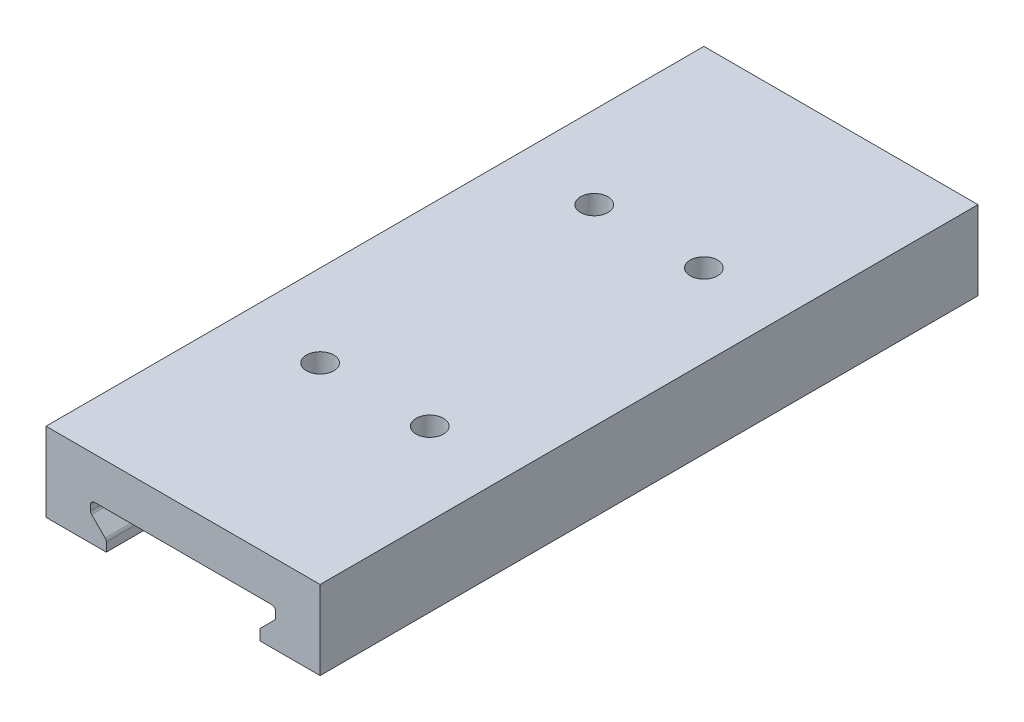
ISO-10303-21;
HEADER;
FILE_DESCRIPTION(('STEP AP214'),'2;1');
FILE_NAME('part.step','',(''),(''),'','','');
FILE_SCHEMA(('AUTOMOTIVE_DESIGN { 1 0 10303 214 1 1 1 1 }'));
ENDSEC;
DATA;
#1=APPLICATION_CONTEXT('core data for automotive mechanical design processes');
#2=APPLICATION_PROTOCOL_DEFINITION('international standard','automotive_design',2000,#1);
#3=PRODUCT_CONTEXT('',#1,'mechanical');
#4=PRODUCT('Part','Part','',(#3));
#5=PRODUCT_RELATED_PRODUCT_CATEGORY('part','',(#4));
#6=PRODUCT_DEFINITION_FORMATION('','',#4);
#7=PRODUCT_DEFINITION_CONTEXT('part definition',#1,'design');
#8=PRODUCT_DEFINITION('design','',#6,#7);
#9=PRODUCT_DEFINITION_SHAPE('','',#8);
#10=(LENGTH_UNIT() NAMED_UNIT(*) SI_UNIT(.MILLI.,.METRE.));
#11=(NAMED_UNIT(*) PLANE_ANGLE_UNIT() SI_UNIT($,.RADIAN.));
#12=(NAMED_UNIT(*) SI_UNIT($,.STERADIAN.) SOLID_ANGLE_UNIT());
#13=UNCERTAINTY_MEASURE_WITH_UNIT(LENGTH_MEASURE(1.E-05),#10,'distance_accuracy_value','');
#14=(GEOMETRIC_REPRESENTATION_CONTEXT(3) GLOBAL_UNCERTAINTY_ASSIGNED_CONTEXT((#13)) GLOBAL_UNIT_ASSIGNED_CONTEXT((#10,
#11,#12)) REPRESENTATION_CONTEXT('',''));
#15=CARTESIAN_POINT('',(0.,0.,0.));
#16=DIRECTION('',(0.,0.,1.));
#17=DIRECTION('',(1.,0.,0.));
#18=AXIS2_PLACEMENT_3D('',#15,#16,#17);
#19=CARTESIAN_POINT('',(-12.5,8.99999999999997,60.));
#20=DIRECTION('',(1.,0.,0.));
#21=DIRECTION('',(0.,0.,-1.));
#22=AXIS2_PLACEMENT_3D('',#19,#20,#21);
#23=PLANE('',#22);
#24=DIRECTION('',(0.,-0.999999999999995,0.));
#25=VECTOR('',#24,1.);
#26=CARTESIAN_POINT('',(-12.5,8.99999999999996,42.));
#27=LINE('',#26,#25);
#28=CARTESIAN_POINT('',(-12.5,1.89999999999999,42.));
#29=VERTEX_POINT('',#28);
#30=CARTESIAN_POINT('',(-12.5,1.8,42.));
#31=VERTEX_POINT('',#30);
#32=EDGE_CURVE('E285',#29,#31,#27,.T.);
#33=ORIENTED_EDGE('',*,*,#32,.F.);
#34=DIRECTION('',(0.,0.,1.));
#35=VECTOR('',#34,1.);
#36=CARTESIAN_POINT('',(-12.5000000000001,1.90000000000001,60.));
#37=LINE('',#36,#35);
#38=CARTESIAN_POINT('',(-12.5,1.89999999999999,42.05));
#39=VERTEX_POINT('',#38);
#40=EDGE_CURVE('E283',#29,#39,#37,.T.);
#41=ORIENTED_EDGE('',*,*,#40,.T.);
#42=DIRECTION('',(0.,0.999999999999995,0.));
#43=VECTOR('',#42,1.);
#44=CARTESIAN_POINT('',(-12.5,8.99999999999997,42.05));
#45=LINE('',#44,#43);
#46=CARTESIAN_POINT('',(-12.5000000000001,1.80000000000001,42.05));
#47=VERTEX_POINT('',#46);
#48=EDGE_CURVE('E268',#47,#39,#45,.T.);
#49=ORIENTED_EDGE('',*,*,#48,.F.);
#50=DIRECTION('',(0.,0.,-1.));
#51=VECTOR('',#50,1.);
#52=CARTESIAN_POINT('',(-12.5,1.80000000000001,60.));
#53=LINE('',#52,#51);
#54=CARTESIAN_POINT('',(-12.5,1.80000000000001,60.));
#55=VERTEX_POINT('',#54);
#56=EDGE_CURVE('E282',#55,#47,#53,.T.);
#57=ORIENTED_EDGE('',*,*,#56,.F.);
#58=DIRECTION('',(0.,-0.999999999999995,0.));
#59=VECTOR('',#58,1.);
#60=CARTESIAN_POINT('',(-12.5,8.99999999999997,60.));
#61=LINE('',#60,#59);
#62=CARTESIAN_POINT('',(-12.5,8.99999999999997,60.));
#63=VERTEX_POINT('',#62);
#64=EDGE_CURVE('E335',#63,#55,#61,.T.);
#65=ORIENTED_EDGE('',*,*,#64,.F.);
#66=DIRECTION('',(0.,0.,-1.));
#67=VECTOR('',#66,1.);
#68=CARTESIAN_POINT('',(-12.5,8.99999999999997,60.));
#69=LINE('',#68,#67);
#70=CARTESIAN_POINT('',(-12.5,8.99999999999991,0.));
#71=VERTEX_POINT('',#70);
#72=EDGE_CURVE('E320',#63,#71,#69,.T.);
#73=ORIENTED_EDGE('',*,*,#72,.T.);
#74=DIRECTION('',(0.,-0.999999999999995,0.));
#75=VECTOR('',#74,1.);
#76=CARTESIAN_POINT('',(-12.5,8.99999999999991,0.));
#77=LINE('',#76,#75);
#78=CARTESIAN_POINT('',(-12.5,1.79999999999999,0.));
#79=VERTEX_POINT('',#78);
#80=EDGE_CURVE('E348',#71,#79,#77,.T.);
#81=ORIENTED_EDGE('',*,*,#80,.T.);
#82=CARTESIAN_POINT('',(-12.5,1.79999999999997,17.9499999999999));
#83=VERTEX_POINT('',#82);
#84=EDGE_CURVE('E295',#83,#79,#53,.T.);
#85=ORIENTED_EDGE('',*,*,#84,.F.);
#86=DIRECTION('',(0.,0.999999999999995,0.));
#87=VECTOR('',#86,1.);
#88=CARTESIAN_POINT('',(-12.5,8.99999999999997,17.9499999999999));
#89=LINE('',#88,#87);
#90=CARTESIAN_POINT('',(-12.5000000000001,1.89999999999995,17.9499999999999));
#91=VERTEX_POINT('',#90);
#92=EDGE_CURVE('E435',#83,#91,#89,.T.);
#93=ORIENTED_EDGE('',*,*,#92,.T.);
#94=DIRECTION('',(0.,0.,1.));
#95=VECTOR('',#94,1.);
#96=CARTESIAN_POINT('',(-12.5000000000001,1.90000000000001,60.));
#97=LINE('',#96,#95);
#98=CARTESIAN_POINT('',(-12.5000000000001,1.89999999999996,17.9999999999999));
#99=VERTEX_POINT('',#98);
#100=EDGE_CURVE('E442',#91,#99,#97,.T.);
#101=ORIENTED_EDGE('',*,*,#100,.T.);
#102=DIRECTION('',(0.,-0.999999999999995,0.));
#103=VECTOR('',#102,1.);
#104=CARTESIAN_POINT('',(-12.5,8.99999999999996,17.9999999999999));
#105=LINE('',#104,#103);
#106=CARTESIAN_POINT('',(-12.5000000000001,1.79999999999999,17.9999999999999));
#107=VERTEX_POINT('',#106);
#108=EDGE_CURVE('E438',#99,#107,#105,.T.);
#109=ORIENTED_EDGE('',*,*,#108,.T.);
#110=EDGE_CURVE('E293',#31,#107,#53,.T.);
#111=ORIENTED_EDGE('',*,*,#110,.F.);
#112=EDGE_LOOP('',(#33,#41,#49,#57,#65,#73,#81,#85,#93,#101,#109,#111));
#113=FACE_BOUND('',#112,.T.);
#114=ADVANCED_FACE('F43',(#113),#23,.F.);
#115=CARTESIAN_POINT('',(-12.5,1.80000000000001,60.));
#116=DIRECTION('',(0.,0.999999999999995,0.));
#117=DIRECTION('',(0.,0.,1.));
#118=AXIS2_PLACEMENT_3D('',#115,#116,#117);
#119=PLANE('',#118);
#120=DIRECTION('',(-1.,0.,0.));
#121=VECTOR('',#120,1.);
#122=CARTESIAN_POINT('',(-4.62506841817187,1.80000000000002,42.));
#123=LINE('',#122,#121);
#124=CARTESIAN_POINT('',(-7.00000000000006,1.80000000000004,42.));
#125=VERTEX_POINT('',#124);
#126=EDGE_CURVE('E275',#125,#31,#123,.T.);
#127=ORIENTED_EDGE('',*,*,#126,.T.);
#128=ORIENTED_EDGE('',*,*,#110,.T.);
#129=DIRECTION('',(-1.,0.,0.));
#130=VECTOR('',#129,1.);
#131=CARTESIAN_POINT('',(-4.62506841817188,1.79999999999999,17.9999999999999));
#132=LINE('',#131,#130);
#133=CARTESIAN_POINT('',(-7.00000000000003,1.8,17.9999999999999));
#134=VERTEX_POINT('',#133);
#135=EDGE_CURVE('E455',#134,#107,#132,.T.);
#136=ORIENTED_EDGE('',*,*,#135,.F.);
#137=DIRECTION('',(0.,0.,1.));
#138=VECTOR('',#137,1.);
#139=CARTESIAN_POINT('',(-7.00000000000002,1.8,60.));
#140=LINE('',#139,#138);
#141=EDGE_CURVE('E355',#134,#125,#140,.T.);
#142=ORIENTED_EDGE('',*,*,#141,.T.);
#143=EDGE_LOOP('',(#127,#128,#136,#142));
#144=FACE_BOUND('',#143,.T.);
#145=ADVANCED_FACE('F473',(#144),#119,.F.);
#146=DIRECTION('',(1.,0.,0.));
#147=VECTOR('',#146,1.);
#148=CARTESIAN_POINT('',(-4.62506841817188,1.80000000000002,42.05));
#149=LINE('',#148,#147);
#150=CARTESIAN_POINT('',(-7.00000000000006,1.80000000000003,42.05));
#151=VERTEX_POINT('',#150);
#152=EDGE_CURVE('E264',#47,#151,#149,.T.);
#153=ORIENTED_EDGE('',*,*,#152,.T.);
#154=CARTESIAN_POINT('',(-7.00000000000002,1.8,60.));
#155=VERTEX_POINT('',#154);
#156=EDGE_CURVE('E356',#151,#155,#140,.T.);
#157=ORIENTED_EDGE('',*,*,#156,.T.);
#158=DIRECTION('',(1.,0.,0.));
#159=VECTOR('',#158,1.);
#160=CARTESIAN_POINT('',(-12.5,1.80000000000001,60.));
#161=LINE('',#160,#159);
#162=EDGE_CURVE('E289',#55,#155,#161,.T.);
#163=ORIENTED_EDGE('',*,*,#162,.F.);
#164=ORIENTED_EDGE('',*,*,#56,.T.);
#165=EDGE_LOOP('',(#153,#157,#163,#164));
#166=FACE_BOUND('',#165,.T.);
#167=ADVANCED_FACE('F287',(#166),#119,.F.);
#168=CARTESIAN_POINT('',(-7.00000000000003,2.76583282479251,60.));
#169=DIRECTION('',(-1.,0.,0.));
#170=DIRECTION('',(0.,-0.999999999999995,0.));
#171=AXIS2_PLACEMENT_3D('',#168,#169,#170);
#172=PLANE('',#171);
#173=DIRECTION('',(0.,0.999999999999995,0.));
#174=VECTOR('',#173,1.);
#175=CARTESIAN_POINT('',(-7.00000000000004,2.76583282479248,42.));
#176=LINE('',#175,#174);
#177=CARTESIAN_POINT('',(-7.00000000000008,1.90000000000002,42.));
#178=VERTEX_POINT('',#177);
#179=EDGE_CURVE('E11',#125,#178,#176,.T.);
#180=ORIENTED_EDGE('',*,*,#179,.F.);
#181=ORIENTED_EDGE('',*,*,#141,.F.);
#182=DIRECTION('',(0.,0.999999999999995,0.));
#183=VECTOR('',#182,1.);
#184=CARTESIAN_POINT('',(-7.00000000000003,2.76583282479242,18.));
#185=LINE('',#184,#183);
#186=CARTESIAN_POINT('',(-7.00000000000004,1.89999999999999,17.9999999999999));
#187=VERTEX_POINT('',#186);
#188=EDGE_CURVE('E488',#134,#187,#185,.T.);
#189=ORIENTED_EDGE('',*,*,#188,.T.);
#190=DIRECTION('',(0.,0.,-1.));
#191=VECTOR('',#190,1.);
#192=CARTESIAN_POINT('',(-6.99999999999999,1.90000000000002,60.0000000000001));
#193=LINE('',#192,#191);
#194=CARTESIAN_POINT('',(-7.00000000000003,1.89999999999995,17.9499999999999));
#195=VERTEX_POINT('',#194);
#196=EDGE_CURVE('E484',#187,#195,#193,.T.);
#197=ORIENTED_EDGE('',*,*,#196,.T.);
#198=DIRECTION('',(0.,-0.999999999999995,0.));
#199=VECTOR('',#198,1.);
#200=CARTESIAN_POINT('',(-7.00000000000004,2.76583282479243,17.95));
#201=LINE('',#200,#199);
#202=CARTESIAN_POINT('',(-7.00000000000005,1.79999999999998,17.9499999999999));
#203=VERTEX_POINT('',#202);
#204=EDGE_CURVE('E493',#195,#203,#201,.T.);
#205=ORIENTED_EDGE('',*,*,#204,.T.);
#206=CARTESIAN_POINT('',(-7.00000000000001,1.79999999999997,0.));
#207=VERTEX_POINT('',#206);
#208=EDGE_CURVE('E351',#207,#203,#140,.T.);
#209=ORIENTED_EDGE('',*,*,#208,.F.);
#210=DIRECTION('',(0.,-0.999999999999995,0.));
#211=VECTOR('',#210,1.);
#212=CARTESIAN_POINT('',(-7.00000000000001,1.79999999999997,0.));
#213=LINE('',#212,#211);
#214=CARTESIAN_POINT('',(-7.00000000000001,2.62085807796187,0.));
#215=VERTEX_POINT('',#214);
#216=EDGE_CURVE('E292',#215,#207,#213,.T.);
#217=ORIENTED_EDGE('',*,*,#216,.F.);
#218=DIRECTION('',(0.,0.,-1.));
#219=VECTOR('',#218,1.);
#220=CARTESIAN_POINT('',(-6.99999999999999,2.62085807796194,60.0000000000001));
#221=LINE('',#220,#219);
#222=CARTESIAN_POINT('',(-6.99999999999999,2.62085807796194,60.0000000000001));
#223=VERTEX_POINT('',#222);
#224=EDGE_CURVE('E575',#215,#223,#221,.F.);
#225=ORIENTED_EDGE('',*,*,#224,.T.);
#226=DIRECTION('',(0.,0.999999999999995,0.));
#227=VECTOR('',#226,1.);
#228=CARTESIAN_POINT('',(-7.00000000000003,2.76583282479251,60.));
#229=LINE('',#228,#227);
#230=EDGE_CURVE('E369',#155,#223,#229,.T.);
#231=ORIENTED_EDGE('',*,*,#230,.F.);
#232=ORIENTED_EDGE('',*,*,#156,.F.);
#233=DIRECTION('',(0.,-0.999999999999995,0.));
#234=VECTOR('',#233,1.);
#235=CARTESIAN_POINT('',(-7.00000000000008,2.76583282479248,42.05));
#236=LINE('',#235,#234);
#237=CARTESIAN_POINT('',(-7.00000000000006,1.90000000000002,42.05));
#238=VERTEX_POINT('',#237);
#239=EDGE_CURVE('E51',#238,#151,#236,.T.);
#240=ORIENTED_EDGE('',*,*,#239,.F.);
#241=DIRECTION('',(0.,0.,-1.));
#242=VECTOR('',#241,1.);
#243=CARTESIAN_POINT('',(-6.99999999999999,1.90000000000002,60.0000000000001));
#244=LINE('',#243,#242);
#245=EDGE_CURVE('E502',#238,#178,#244,.T.);
#246=ORIENTED_EDGE('',*,*,#245,.T.);
#247=EDGE_LOOP('',(#180,#181,#189,#197,#205,#209,#217,#225,#231,#232,#240,#246));
#248=FACE_BOUND('',#247,.T.);
#249=ADVANCED_FACE('F658',(#248),#172,.F.);
#250=ORIENTED_EDGE('',*,*,#208,.T.);
#251=DIRECTION('',(1.,0.,0.));
#252=VECTOR('',#251,1.);
#253=CARTESIAN_POINT('',(-4.62506841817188,1.79999999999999,17.9499999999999));
#254=LINE('',#253,#252);
#255=EDGE_CURVE('E452',#83,#203,#254,.T.);
#256=ORIENTED_EDGE('',*,*,#255,.F.);
#257=ORIENTED_EDGE('',*,*,#84,.T.);
#258=DIRECTION('',(1.,0.,0.));
#259=VECTOR('',#258,1.);
#260=CARTESIAN_POINT('',(-12.5,1.79999999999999,0.));
#261=LINE('',#260,#259);
#262=EDGE_CURVE('E344',#79,#207,#261,.T.);
#263=ORIENTED_EDGE('',*,*,#262,.T.);
#264=EDGE_LOOP('',(#250,#256,#257,#263));
#265=FACE_BOUND('',#264,.T.);
#266=ADVANCED_FACE('F657',(#265),#119,.F.);
#267=DIRECTION('',(0.,0.,1.));
#268=VECTOR('',#267,1.);
#269=CARTESIAN_POINT('',(6.99999999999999,1.80000000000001,60.0000000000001));
#270=LINE('',#269,#268);
#271=CARTESIAN_POINT('',(6.99999999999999,1.79999999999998,0.));
#272=VERTEX_POINT('',#271);
#273=CARTESIAN_POINT('',(6.99999999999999,1.80000000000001,60.0000000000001));
#274=VERTEX_POINT('',#273);
#275=EDGE_CURVE('E385',#272,#274,#270,.T.);
#276=ORIENTED_EDGE('',*,*,#275,.F.);
#277=CARTESIAN_POINT('',(12.5,1.79999999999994,0.));
#278=VERTEX_POINT('',#277);
#279=EDGE_CURVE('E347',#272,#278,#261,.T.);
#280=ORIENTED_EDGE('',*,*,#279,.T.);
#281=DIRECTION('',(0.,0.,-1.));
#282=VECTOR('',#281,1.);
#283=CARTESIAN_POINT('',(12.5,1.80000000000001,60.0000000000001));
#284=LINE('',#283,#282);
#285=CARTESIAN_POINT('',(12.5,1.80000000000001,60.0000000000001));
#286=VERTEX_POINT('',#285);
#287=EDGE_CURVE('E303',#286,#278,#284,.T.);
#288=ORIENTED_EDGE('',*,*,#287,.F.);
#289=EDGE_CURVE('E334',#274,#286,#161,.T.);
#290=ORIENTED_EDGE('',*,*,#289,.F.);
#291=EDGE_LOOP('',(#276,#280,#288,#290));
#292=FACE_BOUND('',#291,.T.);
#293=ADVANCED_FACE('F648',(#292),#119,.F.);
#294=CARTESIAN_POINT('',(-12.5,1.80000000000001,60.));
#295=DIRECTION('',(0.,0.,1.));
#296=DIRECTION('',(1.,0.,0.));
#297=AXIS2_PLACEMENT_3D('',#294,#295,#296);
#298=PLANE('',#297);
#299=DIRECTION('',(0.707106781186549,0.707106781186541,0.));
#300=VECTOR('',#299,1.);
#301=CARTESIAN_POINT('',(8.43416717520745,4.20000000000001,60.0000000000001));
#302=LINE('',#301,#300);
#303=CARTESIAN_POINT('',(7.10251262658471,2.86834545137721,60.0000000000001));
#304=VERTEX_POINT('',#303);
#305=CARTESIAN_POINT('',(8.33165454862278,4.09748737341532,60.));
#306=VERTEX_POINT('',#305);
#307=EDGE_CURVE('E392',#304,#306,#302,.T.);
#308=ORIENTED_EDGE('',*,*,#307,.F.);
#309=CARTESIAN_POINT('',(7.35000000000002,2.62085807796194,60.));
#310=DIRECTION('',(0.,0.,1.));
#311=DIRECTION('',(1.,0.,0.));
#312=AXIS2_PLACEMENT_3D('',#309,#310,#311);
#313=CIRCLE('',#312,0.35);
#314=CARTESIAN_POINT('',(7.00000000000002,2.62085807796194,60.));
#315=VERTEX_POINT('',#314);
#316=EDGE_CURVE('E532',#304,#315,#313,.T.);
#317=ORIENTED_EDGE('',*,*,#316,.T.);
#318=DIRECTION('',(0.,0.999999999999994,0.));
#319=VECTOR('',#318,1.);
#320=CARTESIAN_POINT('',(7.00000000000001,2.76583282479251,60.));
#321=LINE('',#320,#319);
#322=EDGE_CURVE('E388',#274,#315,#321,.T.);
#323=ORIENTED_EDGE('',*,*,#322,.F.);
#324=ORIENTED_EDGE('',*,*,#289,.T.);
#325=DIRECTION('',(0.,0.999999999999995,0.));
#326=VECTOR('',#325,1.);
#327=CARTESIAN_POINT('',(12.5,8.99999999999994,60.));
#328=LINE('',#327,#326);
#329=CARTESIAN_POINT('',(12.5,8.99999999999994,60.));
#330=VERTEX_POINT('',#329);
#331=EDGE_CURVE('E329',#286,#330,#328,.T.);
#332=ORIENTED_EDGE('',*,*,#331,.T.);
#333=DIRECTION('',(-1.,0.,0.));
#334=VECTOR('',#333,1.);
#335=CARTESIAN_POINT('',(-12.5,8.99999999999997,60.));
#336=LINE('',#335,#334);
#337=EDGE_CURVE('E326',#330,#63,#336,.T.);
#338=ORIENTED_EDGE('',*,*,#337,.T.);
#339=ORIENTED_EDGE('',*,*,#64,.T.);
#340=ORIENTED_EDGE('',*,*,#162,.T.);
#341=ORIENTED_EDGE('',*,*,#230,.T.);
#342=CARTESIAN_POINT('',(-7.35000000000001,2.62085807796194,60.));
#343=DIRECTION('',(0.,0.,1.));
#344=DIRECTION('',(1.,0.,0.));
#345=AXIS2_PLACEMENT_3D('',#342,#343,#344);
#346=CIRCLE('',#345,0.35);
#347=CARTESIAN_POINT('',(-7.10251262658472,2.86834545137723,60.0000000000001));
#348=VERTEX_POINT('',#347);
#349=EDGE_CURVE('E572',#223,#348,#346,.T.);
#350=ORIENTED_EDGE('',*,*,#349,.T.);
#351=DIRECTION('',(-0.707106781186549,0.707106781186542,0.));
#352=VECTOR('',#351,1.);
#353=CARTESIAN_POINT('',(-8.43416717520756,4.20000000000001,60.0000000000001));
#354=LINE('',#353,#352);
#355=CARTESIAN_POINT('',(-8.33165454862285,4.09748737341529,60.));
#356=VERTEX_POINT('',#355);
#357=EDGE_CURVE('E365',#348,#356,#354,.T.);
#358=ORIENTED_EDGE('',*,*,#357,.T.);
#359=CARTESIAN_POINT('',(-8.08416717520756,4.34497474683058,60.));
#360=DIRECTION('',(0.,0.,1.));
#361=DIRECTION('',(1.,0.,0.));
#362=AXIS2_PLACEMENT_3D('',#359,#360,#361);
#363=CIRCLE('',#362,0.35);
#364=CARTESIAN_POINT('',(-8.43416717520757,4.3449747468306,60.));
#365=VERTEX_POINT('',#364);
#366=EDGE_CURVE('E555',#356,#365,#363,.F.);
#367=ORIENTED_EDGE('',*,*,#366,.T.);
#368=DIRECTION('',(0.,0.999999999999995,0.));
#369=VECTOR('',#368,1.);
#370=CARTESIAN_POINT('',(-8.43416717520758,5.19999999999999,60.));
#371=LINE('',#370,#369);
#372=CARTESIAN_POINT('',(-8.43416717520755,4.85000000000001,60.));
#373=VERTEX_POINT('',#372);
#374=EDGE_CURVE('E361',#365,#373,#371,.T.);
#375=ORIENTED_EDGE('',*,*,#374,.T.);
#376=CARTESIAN_POINT('',(-8.08416717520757,4.85000000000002,60.));
#377=DIRECTION('',(0.,0.,1.));
#378=DIRECTION('',(1.,0.,0.));
#379=AXIS2_PLACEMENT_3D('',#376,#377,#378);
#380=CIRCLE('',#379,0.35);
#381=CARTESIAN_POINT('',(-8.08416717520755,5.2,60.));
#382=VERTEX_POINT('',#381);
#383=EDGE_CURVE('E549',#373,#382,#380,.F.);
#384=ORIENTED_EDGE('',*,*,#383,.T.);
#385=DIRECTION('',(1.,0.,0.));
#386=VECTOR('',#385,1.);
#387=CARTESIAN_POINT('',(-7.00000000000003,5.20000000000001,60.));
#388=LINE('',#387,#386);
#389=CARTESIAN_POINT('',(8.08416717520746,5.19999999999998,60.));
#390=VERTEX_POINT('',#389);
#391=EDGE_CURVE('E357',#382,#390,#388,.T.);
#392=ORIENTED_EDGE('',*,*,#391,.T.);
#393=CARTESIAN_POINT('',(8.08416717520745,4.85000000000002,60.));
#394=DIRECTION('',(0.,0.,1.));
#395=DIRECTION('',(1.,0.,0.));
#396=AXIS2_PLACEMENT_3D('',#393,#394,#395);
#397=CIRCLE('',#396,0.35);
#398=CARTESIAN_POINT('',(8.43416717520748,4.85000000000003,60.));
#399=VERTEX_POINT('',#398);
#400=EDGE_CURVE('E489',#390,#399,#397,.F.);
#401=ORIENTED_EDGE('',*,*,#400,.T.);
#402=DIRECTION('',(0.,0.999999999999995,0.));
#403=VECTOR('',#402,1.);
#404=CARTESIAN_POINT('',(8.43416717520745,5.2,60.));
#405=LINE('',#404,#403);
#406=CARTESIAN_POINT('',(8.43416717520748,4.34497474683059,60.));
#407=VERTEX_POINT('',#406);
#408=EDGE_CURVE('E396',#407,#399,#405,.T.);
#409=ORIENTED_EDGE('',*,*,#408,.F.);
#410=CARTESIAN_POINT('',(8.08416717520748,4.3449747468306,60.));
#411=DIRECTION('',(0.,0.,1.));
#412=DIRECTION('',(1.,0.,0.));
#413=AXIS2_PLACEMENT_3D('',#410,#411,#412);
#414=CIRCLE('',#413,0.35);
#415=EDGE_CURVE('E517',#407,#306,#414,.F.);
#416=ORIENTED_EDGE('',*,*,#415,.T.);
#417=EDGE_LOOP('',(#308,#317,#323,#324,#332,#338,#339,#340,#341,#350,#358,#367,#375,#384,#392,
#401,#409,#416));
#418=FACE_BOUND('',#417,.T.);
#419=ADVANCED_FACE('F596',(#418),#298,.T.);
#420=CARTESIAN_POINT('',(-12.5,1.79999999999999,0.));
#421=DIRECTION('',(0.,0.,1.));
#422=DIRECTION('',(1.,0.,0.));
#423=AXIS2_PLACEMENT_3D('',#420,#421,#422);
#424=PLANE('',#423);
#425=DIRECTION('',(0.,0.999999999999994,0.));
#426=VECTOR('',#425,1.);
#427=CARTESIAN_POINT('',(7.00000000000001,2.76583282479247,0.));
#428=LINE('',#427,#426);
#429=CARTESIAN_POINT('',(7.00000000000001,2.62085807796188,0.));
#430=VERTEX_POINT('',#429);
#431=EDGE_CURVE('E400',#272,#430,#428,.T.);
#432=ORIENTED_EDGE('',*,*,#431,.T.);
#433=CARTESIAN_POINT('',(7.35000000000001,2.62085807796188,0.));
#434=DIRECTION('',(0.,0.,1.));
#435=DIRECTION('',(1.,0.,0.));
#436=AXIS2_PLACEMENT_3D('',#433,#434,#435);
#437=CIRCLE('',#436,0.35);
#438=CARTESIAN_POINT('',(7.10251262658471,2.86834545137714,0.));
#439=VERTEX_POINT('',#438);
#440=EDGE_CURVE('E542',#430,#439,#437,.F.);
#441=ORIENTED_EDGE('',*,*,#440,.T.);
#442=DIRECTION('',(0.707106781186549,0.707106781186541,0.));
#443=VECTOR('',#442,1.);
#444=CARTESIAN_POINT('',(8.43416717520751,4.19999999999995,0.));
#445=LINE('',#444,#443);
#446=CARTESIAN_POINT('',(8.33165454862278,4.09748737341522,0.));
#447=VERTEX_POINT('',#446);
#448=EDGE_CURVE('E404',#439,#447,#445,.T.);
#449=ORIENTED_EDGE('',*,*,#448,.T.);
#450=CARTESIAN_POINT('',(8.0841671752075,4.34497474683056,0.));
#451=DIRECTION('',(0.,0.,1.));
#452=DIRECTION('',(1.,0.,0.));
#453=AXIS2_PLACEMENT_3D('',#450,#451,#452);
#454=CIRCLE('',#453,0.35);
#455=CARTESIAN_POINT('',(8.43416717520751,4.34497474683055,0.));
#456=VERTEX_POINT('',#455);
#457=EDGE_CURVE('E520',#447,#456,#454,.T.);
#458=ORIENTED_EDGE('',*,*,#457,.T.);
#459=DIRECTION('',(0.,0.999999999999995,0.));
#460=VECTOR('',#459,1.);
#461=CARTESIAN_POINT('',(8.43416717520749,5.19999999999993,0.));
#462=LINE('',#461,#460);
#463=CARTESIAN_POINT('',(8.43416717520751,4.84999999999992,0.));
#464=VERTEX_POINT('',#463);
#465=EDGE_CURVE('E408',#456,#464,#462,.T.);
#466=ORIENTED_EDGE('',*,*,#465,.T.);
#467=CARTESIAN_POINT('',(8.0841671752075,4.84999999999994,0.));
#468=DIRECTION('',(0.,0.,1.));
#469=DIRECTION('',(1.,0.,0.));
#470=AXIS2_PLACEMENT_3D('',#467,#468,#469);
#471=CIRCLE('',#470,0.35);
#472=CARTESIAN_POINT('',(8.0841671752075,5.19999999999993,0.));
#473=VERTEX_POINT('',#472);
#474=EDGE_CURVE('E496',#464,#473,#471,.T.);
#475=ORIENTED_EDGE('',*,*,#474,.T.);
#476=DIRECTION('',(1.,0.,0.));
#477=VECTOR('',#476,1.);
#478=CARTESIAN_POINT('',(0.,5.19999999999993,0.));
#479=LINE('',#478,#477);
#480=CARTESIAN_POINT('',(-8.08416717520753,5.1999999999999,0.));
#481=VERTEX_POINT('',#480);
#482=EDGE_CURVE('E373',#481,#473,#479,.T.);
#483=ORIENTED_EDGE('',*,*,#482,.F.);
#484=CARTESIAN_POINT('',(-8.08416717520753,4.84999999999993,0.));
#485=DIRECTION('',(0.,0.,1.));
#486=DIRECTION('',(1.,0.,0.));
#487=AXIS2_PLACEMENT_3D('',#484,#485,#486);
#488=CIRCLE('',#487,0.35);
#489=CARTESIAN_POINT('',(-8.43416717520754,4.84999999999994,0.));
#490=VERTEX_POINT('',#489);
#491=EDGE_CURVE('E552',#481,#490,#488,.T.);
#492=ORIENTED_EDGE('',*,*,#491,.T.);
#493=DIRECTION('',(0.,0.999999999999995,0.));
#494=VECTOR('',#493,1.);
#495=CARTESIAN_POINT('',(-8.43416717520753,5.19999999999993,0.));
#496=LINE('',#495,#494);
#497=CARTESIAN_POINT('',(-8.43416717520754,4.34497474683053,0.));
#498=VERTEX_POINT('',#497);
#499=EDGE_CURVE('E377',#498,#490,#496,.T.);
#500=ORIENTED_EDGE('',*,*,#499,.F.);
#501=CARTESIAN_POINT('',(-8.08416717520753,4.34497474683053,0.));
#502=DIRECTION('',(0.,0.,1.));
#503=DIRECTION('',(1.,0.,0.));
#504=AXIS2_PLACEMENT_3D('',#501,#502,#503);
#505=CIRCLE('',#504,0.35);
#506=CARTESIAN_POINT('',(-8.33165454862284,4.09748737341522,0.));
#507=VERTEX_POINT('',#506);
#508=EDGE_CURVE('E558',#498,#507,#505,.T.);
#509=ORIENTED_EDGE('',*,*,#508,.T.);
#510=DIRECTION('',(-0.707106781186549,0.707106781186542,0.));
#511=VECTOR('',#510,1.);
#512=CARTESIAN_POINT('',(-8.43416717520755,4.19999999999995,0.));
#513=LINE('',#512,#511);
#514=CARTESIAN_POINT('',(-7.10251262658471,2.86834545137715,0.));
#515=VERTEX_POINT('',#514);
#516=EDGE_CURVE('E381',#515,#507,#513,.T.);
#517=ORIENTED_EDGE('',*,*,#516,.F.);
#518=CARTESIAN_POINT('',(-7.35000000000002,2.62085807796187,0.));
#519=DIRECTION('',(0.,0.,1.));
#520=DIRECTION('',(1.,0.,0.));
#521=AXIS2_PLACEMENT_3D('',#518,#519,#520);
#522=CIRCLE('',#521,0.35);
#523=EDGE_CURVE('E578',#515,#215,#522,.F.);
#524=ORIENTED_EDGE('',*,*,#523,.T.);
#525=ORIENTED_EDGE('',*,*,#216,.T.);
#526=ORIENTED_EDGE('',*,*,#262,.F.);
#527=ORIENTED_EDGE('',*,*,#80,.F.);
#528=DIRECTION('',(-1.,0.,0.));
#529=VECTOR('',#528,1.);
#530=CARTESIAN_POINT('',(-12.5,8.99999999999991,0.));
#531=LINE('',#530,#529);
#532=CARTESIAN_POINT('',(12.5,8.9999999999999,0.));
#533=VERTEX_POINT('',#532);
#534=EDGE_CURVE('E338',#533,#71,#531,.T.);
#535=ORIENTED_EDGE('',*,*,#534,.F.);
#536=DIRECTION('',(0.,0.999999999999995,0.));
#537=VECTOR('',#536,1.);
#538=CARTESIAN_POINT('',(12.5,8.9999999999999,0.));
#539=LINE('',#538,#537);
#540=EDGE_CURVE('E341',#278,#533,#539,.T.);
#541=ORIENTED_EDGE('',*,*,#540,.F.);
#542=ORIENTED_EDGE('',*,*,#279,.F.);
#543=EDGE_LOOP('',(#432,#441,#449,#458,#466,#475,#483,#492,#500,#509,#517,#524,#525,#526,#527,
#535,#541,#542));
#544=FACE_BOUND('',#543,.T.);
#545=ADVANCED_FACE('F606',(#544),#424,.F.);
#546=CARTESIAN_POINT('',(12.5,8.99999999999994,60.));
#547=DIRECTION('',(-1.,0.,0.));
#548=DIRECTION('',(0.,0.,1.));
#549=AXIS2_PLACEMENT_3D('',#546,#547,#548);
#550=PLANE('',#549);
#551=ORIENTED_EDGE('',*,*,#540,.T.);
#552=DIRECTION('',(0.,0.,-1.));
#553=VECTOR('',#552,1.);
#554=CARTESIAN_POINT('',(12.5,8.99999999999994,60.));
#555=LINE('',#554,#553);
#556=EDGE_CURVE('E313',#330,#533,#555,.T.);
#557=ORIENTED_EDGE('',*,*,#556,.F.);
#558=ORIENTED_EDGE('',*,*,#331,.F.);
#559=ORIENTED_EDGE('',*,*,#287,.T.);
#560=EDGE_LOOP('',(#551,#557,#558,#559));
#561=FACE_BOUND('',#560,.T.);
#562=ADVANCED_FACE('F649',(#561),#550,.F.);
#563=CARTESIAN_POINT('',(-12.5,8.99999999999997,60.));
#564=DIRECTION('',(0.,-0.999999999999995,0.));
#565=DIRECTION('',(0.,0.,-1.));
#566=AXIS2_PLACEMENT_3D('',#563,#564,#565);
#567=PLANE('',#566);
#568=CARTESIAN_POINT('',(-5.00000000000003,8.99999999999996,42.5));
#569=DIRECTION('',(0.,0.999999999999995,0.));
#570=DIRECTION('',(0.,0.,1.));
#571=AXIS2_PLACEMENT_3D('',#568,#569,#570);
#572=CIRCLE('',#571,1.24999999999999);
#573=CARTESIAN_POINT('',(-5.00000000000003,8.99999999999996,43.75));
#574=VERTEX_POINT('',#573);
#575=EDGE_CURVE('E431',#574,#574,#572,.T.);
#576=ORIENTED_EDGE('',*,*,#575,.F.);
#577=EDGE_LOOP('',(#576));
#578=FACE_BOUND('',#577,.T.);
#579=CARTESIAN_POINT('',(4.99999999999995,9.,42.5));
#580=DIRECTION('',(0.,0.999999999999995,0.));
#581=DIRECTION('',(0.,0.,1.));
#582=AXIS2_PLACEMENT_3D('',#579,#580,#581);
#583=CIRCLE('',#582,1.24999999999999);
#584=CARTESIAN_POINT('',(4.99999999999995,9.,43.75));
#585=VERTEX_POINT('',#584);
#586=EDGE_CURVE('E423',#585,#585,#583,.T.);
#587=ORIENTED_EDGE('',*,*,#586,.F.);
#588=EDGE_LOOP('',(#587));
#589=FACE_BOUND('',#588,.T.);
#590=CARTESIAN_POINT('',(5.,8.99999999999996,17.4999999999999));
#591=DIRECTION('',(0.,0.999999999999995,0.));
#592=DIRECTION('',(0.,0.,1.));
#593=AXIS2_PLACEMENT_3D('',#590,#591,#592);
#594=CIRCLE('',#593,1.24999999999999);
#595=CARTESIAN_POINT('',(5.,8.99999999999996,18.7499999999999));
#596=VERTEX_POINT('',#595);
#597=EDGE_CURVE('E418',#596,#596,#594,.T.);
#598=ORIENTED_EDGE('',*,*,#597,.F.);
#599=EDGE_LOOP('',(#598));
#600=FACE_BOUND('',#599,.T.);
#601=CARTESIAN_POINT('',(-5.00000000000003,8.99999999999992,17.5));
#602=DIRECTION('',(0.,0.999999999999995,0.));
#603=DIRECTION('',(0.,0.,1.));
#604=AXIS2_PLACEMENT_3D('',#601,#602,#603);
#605=CIRCLE('',#604,1.24999999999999);
#606=CARTESIAN_POINT('',(-5.00000000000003,8.99999999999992,18.75));
#607=VERTEX_POINT('',#606);
#608=EDGE_CURVE('E413',#607,#607,#605,.T.);
#609=ORIENTED_EDGE('',*,*,#608,.F.);
#610=EDGE_LOOP('',(#609));
#611=FACE_BOUND('',#610,.T.);
#612=ORIENTED_EDGE('',*,*,#534,.T.);
#613=ORIENTED_EDGE('',*,*,#72,.F.);
#614=ORIENTED_EDGE('',*,*,#337,.F.);
#615=ORIENTED_EDGE('',*,*,#556,.T.);
#616=EDGE_LOOP('',(#612,#613,#614,#615));
#617=FACE_BOUND('',#616,.T.);
#618=ADVANCED_FACE('F653',(#578,#589,#600,#611,#617),#567,.F.);
#619=CARTESIAN_POINT('',(0.,5.20000000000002,60.));
#620=DIRECTION('',(0.,0.999999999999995,0.));
#621=DIRECTION('',(0.,0.,1.));
#622=AXIS2_PLACEMENT_3D('',#619,#620,#621);
#623=PLANE('',#622);
#624=CARTESIAN_POINT('',(-5.00000000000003,5.20000000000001,42.5));
#625=DIRECTION('',(0.,0.999999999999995,0.));
#626=DIRECTION('',(0.,0.,1.));
#627=AXIS2_PLACEMENT_3D('',#624,#625,#626);
#628=CIRCLE('',#627,1.24999999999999);
#629=CARTESIAN_POINT('',(-5.00000000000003,5.20000000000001,43.75));
#630=VERTEX_POINT('',#629);
#631=EDGE_CURVE('E427',#630,#630,#628,.T.);
#632=ORIENTED_EDGE('',*,*,#631,.T.);
#633=EDGE_LOOP('',(#632));
#634=FACE_BOUND('',#633,.T.);
#635=CARTESIAN_POINT('',(4.99999999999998,5.19999999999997,42.5));
#636=DIRECTION('',(0.,0.999999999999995,0.));
#637=DIRECTION('',(0.,0.,1.));
#638=AXIS2_PLACEMENT_3D('',#635,#636,#637);
#639=CIRCLE('',#638,1.24999999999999);
#640=CARTESIAN_POINT('',(4.99999999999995,5.19999999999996,43.75));
#641=VERTEX_POINT('',#640);
#642=EDGE_CURVE('E422',#641,#641,#639,.T.);
#643=ORIENTED_EDGE('',*,*,#642,.T.);
#644=EDGE_LOOP('',(#643));
#645=FACE_BOUND('',#644,.T.);
#646=CARTESIAN_POINT('',(4.99999999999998,5.19999999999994,17.5));
#647=DIRECTION('',(0.,0.999999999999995,0.));
#648=DIRECTION('',(0.,0.,1.));
#649=AXIS2_PLACEMENT_3D('',#646,#647,#648);
#650=CIRCLE('',#649,1.24999999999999);
#651=CARTESIAN_POINT('',(5.,5.19999999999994,18.7499999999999));
#652=VERTEX_POINT('',#651);
#653=EDGE_CURVE('E417',#652,#652,#650,.T.);
#654=ORIENTED_EDGE('',*,*,#653,.T.);
#655=EDGE_LOOP('',(#654));
#656=FACE_BOUND('',#655,.T.);
#657=CARTESIAN_POINT('',(-5.00000000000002,5.19999999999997,17.5));
#658=DIRECTION('',(0.,0.999999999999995,0.));
#659=DIRECTION('',(0.,0.,1.));
#660=AXIS2_PLACEMENT_3D('',#657,#658,#659);
#661=CIRCLE('',#660,1.24999999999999);
#662=CARTESIAN_POINT('',(-5.00000000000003,5.19999999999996,18.7499999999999));
#663=VERTEX_POINT('',#662);
#664=EDGE_CURVE('E412',#663,#663,#661,.T.);
#665=ORIENTED_EDGE('',*,*,#664,.T.);
#666=EDGE_LOOP('',(#665));
#667=FACE_BOUND('',#666,.T.);
#668=ORIENTED_EDGE('',*,*,#482,.T.);
#669=DIRECTION('',(0.,0.,-1.));
#670=VECTOR('',#669,1.);
#671=CARTESIAN_POINT('',(8.08416717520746,5.19999999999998,60.));
#672=LINE('',#671,#670);
#673=EDGE_CURVE('E523',#473,#390,#672,.F.);
#674=ORIENTED_EDGE('',*,*,#673,.T.);
#675=ORIENTED_EDGE('',*,*,#391,.F.);
#676=DIRECTION('',(0.,0.,-1.));
#677=VECTOR('',#676,1.);
#678=CARTESIAN_POINT('',(-8.08416717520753,5.1999999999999,0.));
#679=LINE('',#678,#677);
#680=EDGE_CURVE('E561',#382,#481,#679,.T.);
#681=ORIENTED_EDGE('',*,*,#680,.T.);
#682=EDGE_LOOP('',(#668,#674,#675,#681));
#683=FACE_BOUND('',#682,.T.);
#684=ADVANCED_FACE('F614',(#634,#645,#656,#667,#683),#623,.F.);
#685=CARTESIAN_POINT('',(-8.43416717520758,5.19999999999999,60.));
#686=DIRECTION('',(-1.,0.,0.));
#687=DIRECTION('',(0.,0.,1.));
#688=AXIS2_PLACEMENT_3D('',#685,#686,#687);
#689=PLANE('',#688);
#690=ORIENTED_EDGE('',*,*,#374,.F.);
#691=DIRECTION('',(0.,0.,-1.));
#692=VECTOR('',#691,1.);
#693=CARTESIAN_POINT('',(-8.43416717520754,4.34497474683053,0.));
#694=LINE('',#693,#692);
#695=EDGE_CURVE('E565',#365,#498,#694,.T.);
#696=ORIENTED_EDGE('',*,*,#695,.T.);
#697=ORIENTED_EDGE('',*,*,#499,.T.);
#698=DIRECTION('',(0.,0.,-1.));
#699=VECTOR('',#698,1.);
#700=CARTESIAN_POINT('',(-8.43416717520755,4.85000000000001,60.));
#701=LINE('',#700,#699);
#702=EDGE_CURVE('E569',#490,#373,#701,.F.);
#703=ORIENTED_EDGE('',*,*,#702,.T.);
#704=EDGE_LOOP('',(#690,#696,#697,#703));
#705=FACE_BOUND('',#704,.T.);
#706=ADVANCED_FACE('F603',(#705),#689,.F.);
#707=CARTESIAN_POINT('',(-8.43416717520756,4.20000000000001,60.0000000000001));
#708=DIRECTION('',(-0.707106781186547,-0.707106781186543,0.));
#709=DIRECTION('',(0.70710678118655,-0.707106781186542,0.));
#710=AXIS2_PLACEMENT_3D('',#707,#708,#709);
#711=PLANE('',#710);
#712=ORIENTED_EDGE('',*,*,#357,.F.);
#713=DIRECTION('',(0.,0.,-1.));
#714=VECTOR('',#713,1.);
#715=CARTESIAN_POINT('',(-7.10251262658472,2.86834545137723,60.0000000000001));
#716=LINE('',#715,#714);
#717=EDGE_CURVE('E581',#348,#515,#716,.T.);
#718=ORIENTED_EDGE('',*,*,#717,.T.);
#719=ORIENTED_EDGE('',*,*,#516,.T.);
#720=DIRECTION('',(0.,0.,-1.));
#721=VECTOR('',#720,1.);
#722=CARTESIAN_POINT('',(-8.33165454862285,4.09748737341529,60.));
#723=LINE('',#722,#721);
#724=EDGE_CURVE('E298',#507,#356,#723,.F.);
#725=ORIENTED_EDGE('',*,*,#724,.T.);
#726=EDGE_LOOP('',(#712,#718,#719,#725));
#727=FACE_BOUND('',#726,.T.);
#728=ADVANCED_FACE('F589',(#727),#711,.F.);
#729=CARTESIAN_POINT('',(-7.35000000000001,2.62085807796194,60.));
#730=DIRECTION('',(0.,0.,-1.));
#731=DIRECTION('',(-1.,0.,0.));
#732=AXIS2_PLACEMENT_3D('',#729,#730,#731);
#733=CYLINDRICAL_SURFACE('',#732,0.35);
#734=ORIENTED_EDGE('',*,*,#349,.F.);
#735=ORIENTED_EDGE('',*,*,#224,.F.);
#736=ORIENTED_EDGE('',*,*,#523,.F.);
#737=ORIENTED_EDGE('',*,*,#717,.F.);
#738=EDGE_LOOP('',(#734,#735,#736,#737));
#739=FACE_BOUND('',#738,.T.);
#740=ADVANCED_FACE('F726',(#739),#733,.T.);
#741=CARTESIAN_POINT('',(-8.08416717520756,4.34497474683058,60.));
#742=DIRECTION('',(0.,0.,1.));
#743=DIRECTION('',(1.,0.,0.));
#744=AXIS2_PLACEMENT_3D('',#741,#742,#743);
#745=CYLINDRICAL_SURFACE('',#744,0.35);
#746=ORIENTED_EDGE('',*,*,#366,.F.);
#747=ORIENTED_EDGE('',*,*,#724,.F.);
#748=ORIENTED_EDGE('',*,*,#508,.F.);
#749=ORIENTED_EDGE('',*,*,#695,.F.);
#750=EDGE_LOOP('',(#746,#747,#748,#749));
#751=FACE_BOUND('',#750,.T.);
#752=ADVANCED_FACE('F600',(#751),#745,.F.);
#753=CARTESIAN_POINT('',(-8.08416717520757,4.85000000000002,60.));
#754=DIRECTION('',(0.,0.,1.));
#755=DIRECTION('',(1.,0.,0.));
#756=AXIS2_PLACEMENT_3D('',#753,#754,#755);
#757=CYLINDRICAL_SURFACE('',#756,0.35);
#758=ORIENTED_EDGE('',*,*,#383,.F.);
#759=ORIENTED_EDGE('',*,*,#702,.F.);
#760=ORIENTED_EDGE('',*,*,#491,.F.);
#761=ORIENTED_EDGE('',*,*,#680,.F.);
#762=EDGE_LOOP('',(#758,#759,#760,#761));
#763=FACE_BOUND('',#762,.T.);
#764=ADVANCED_FACE('F611',(#763),#757,.F.);
#765=CARTESIAN_POINT('',(7.00000000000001,2.76583282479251,60.));
#766=DIRECTION('',(-1.,0.,0.));
#767=DIRECTION('',(0.,-0.999999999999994,0.));
#768=AXIS2_PLACEMENT_3D('',#765,#766,#767);
#769=PLANE('',#768);
#770=ORIENTED_EDGE('',*,*,#322,.T.);
#771=DIRECTION('',(0.,0.,-1.));
#772=VECTOR('',#771,1.);
#773=CARTESIAN_POINT('',(7.00000000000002,2.62085807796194,60.));
#774=LINE('',#773,#772);
#775=EDGE_CURVE('E545',#315,#430,#774,.T.);
#776=ORIENTED_EDGE('',*,*,#775,.T.);
#777=ORIENTED_EDGE('',*,*,#431,.F.);
#778=ORIENTED_EDGE('',*,*,#275,.T.);
#779=EDGE_LOOP('',(#770,#776,#777,#778));
#780=FACE_BOUND('',#779,.T.);
#781=ADVANCED_FACE('F639',(#780),#769,.T.);
#782=CARTESIAN_POINT('',(8.43416717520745,4.20000000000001,60.0000000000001));
#783=DIRECTION('',(-0.707106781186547,0.707106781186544,0.));
#784=DIRECTION('',(-0.707106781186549,-0.707106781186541,0.));
#785=AXIS2_PLACEMENT_3D('',#782,#783,#784);
#786=PLANE('',#785);
#787=ORIENTED_EDGE('',*,*,#448,.F.);
#788=DIRECTION('',(0.,0.,-1.));
#789=VECTOR('',#788,1.);
#790=CARTESIAN_POINT('',(7.10251262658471,2.86834545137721,60.0000000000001));
#791=LINE('',#790,#789);
#792=EDGE_CURVE('E535',#439,#304,#791,.F.);
#793=ORIENTED_EDGE('',*,*,#792,.T.);
#794=ORIENTED_EDGE('',*,*,#307,.T.);
#795=DIRECTION('',(0.,0.,-1.));
#796=VECTOR('',#795,1.);
#797=CARTESIAN_POINT('',(8.33165454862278,4.09748737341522,0.));
#798=LINE('',#797,#796);
#799=EDGE_CURVE('E538',#306,#447,#798,.T.);
#800=ORIENTED_EDGE('',*,*,#799,.T.);
#801=EDGE_LOOP('',(#787,#793,#794,#800));
#802=FACE_BOUND('',#801,.T.);
#803=ADVANCED_FACE('F631',(#802),#786,.T.);
#804=CARTESIAN_POINT('',(8.43416717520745,5.2,60.));
#805=DIRECTION('',(-1.,0.,0.));
#806=DIRECTION('',(0.,0.,1.));
#807=AXIS2_PLACEMENT_3D('',#804,#805,#806);
#808=PLANE('',#807);
#809=ORIENTED_EDGE('',*,*,#465,.F.);
#810=DIRECTION('',(0.,0.,-1.));
#811=VECTOR('',#810,1.);
#812=CARTESIAN_POINT('',(8.43416717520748,4.34497474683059,60.));
#813=LINE('',#812,#811);
#814=EDGE_CURVE('E526',#456,#407,#813,.F.);
#815=ORIENTED_EDGE('',*,*,#814,.T.);
#816=ORIENTED_EDGE('',*,*,#408,.T.);
#817=DIRECTION('',(0.,0.,-1.));
#818=VECTOR('',#817,1.);
#819=CARTESIAN_POINT('',(8.43416717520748,4.85000000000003,60.));
#820=LINE('',#819,#818);
#821=EDGE_CURVE('E529',#399,#464,#820,.T.);
#822=ORIENTED_EDGE('',*,*,#821,.T.);
#823=EDGE_LOOP('',(#809,#815,#816,#822));
#824=FACE_BOUND('',#823,.T.);
#825=ADVANCED_FACE('F623',(#824),#808,.T.);
#826=CARTESIAN_POINT('',(7.35000000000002,2.62085807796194,60.));
#827=DIRECTION('',(0.,0.,-1.));
#828=DIRECTION('',(-1.,0.,0.));
#829=AXIS2_PLACEMENT_3D('',#826,#827,#828);
#830=CYLINDRICAL_SURFACE('',#829,0.35);
#831=ORIENTED_EDGE('',*,*,#316,.F.);
#832=ORIENTED_EDGE('',*,*,#792,.F.);
#833=ORIENTED_EDGE('',*,*,#440,.F.);
#834=ORIENTED_EDGE('',*,*,#775,.F.);
#835=EDGE_LOOP('',(#831,#832,#833,#834));
#836=FACE_BOUND('',#835,.T.);
#837=ADVANCED_FACE('F637',(#836),#830,.T.);
#838=CARTESIAN_POINT('',(8.08416717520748,4.3449747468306,60.));
#839=DIRECTION('',(0.,0.,1.));
#840=DIRECTION('',(1.,0.,0.));
#841=AXIS2_PLACEMENT_3D('',#838,#839,#840);
#842=CYLINDRICAL_SURFACE('',#841,0.35);
#843=ORIENTED_EDGE('',*,*,#415,.F.);
#844=ORIENTED_EDGE('',*,*,#814,.F.);
#845=ORIENTED_EDGE('',*,*,#457,.F.);
#846=ORIENTED_EDGE('',*,*,#799,.F.);
#847=EDGE_LOOP('',(#843,#844,#845,#846));
#848=FACE_BOUND('',#847,.T.);
#849=ADVANCED_FACE('F629',(#848),#842,.F.);
#850=CARTESIAN_POINT('',(8.08416717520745,4.85000000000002,60.));
#851=DIRECTION('',(0.,0.,-1.));
#852=DIRECTION('',(-1.,0.,0.));
#853=AXIS2_PLACEMENT_3D('',#850,#851,#852);
#854=CYLINDRICAL_SURFACE('',#853,0.35);
#855=ORIENTED_EDGE('',*,*,#400,.F.);
#856=ORIENTED_EDGE('',*,*,#673,.F.);
#857=ORIENTED_EDGE('',*,*,#474,.F.);
#858=ORIENTED_EDGE('',*,*,#821,.F.);
#859=EDGE_LOOP('',(#855,#856,#857,#858));
#860=FACE_BOUND('',#859,.T.);
#861=ADVANCED_FACE('F620',(#860),#854,.F.);
#862=CARTESIAN_POINT('',(-5.00000000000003,8.99999999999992,17.5));
#863=DIRECTION('',(0.,0.999999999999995,0.));
#864=DIRECTION('',(0.,0.,1.));
#865=AXIS2_PLACEMENT_3D('',#862,#863,#864);
#866=CYLINDRICAL_SURFACE('',#865,1.24999999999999);
#867=CARTESIAN_POINT('',(-5.00000000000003,8.99999999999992,18.75));
#868=CARTESIAN_POINT('',(-5.00000000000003,8.96041666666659,18.75));
#869=CARTESIAN_POINT('',(-5.00000000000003,8.92083333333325,18.75));
#870=CARTESIAN_POINT('',(-5.00000000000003,8.84166666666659,18.75));
#871=CARTESIAN_POINT('',(-5.00000000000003,8.80208333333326,18.75));
#872=CARTESIAN_POINT('',(-5.00000000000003,8.72291666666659,18.75));
#873=CARTESIAN_POINT('',(-5.00000000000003,8.68333333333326,18.75));
#874=CARTESIAN_POINT('',(-5.00000000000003,8.60416666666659,18.75));
#875=CARTESIAN_POINT('',(-5.00000000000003,8.56458333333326,18.75));
#876=CARTESIAN_POINT('',(-5.00000000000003,8.48541666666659,18.75));
#877=CARTESIAN_POINT('',(-5.00000000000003,8.44583333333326,18.75));
#878=CARTESIAN_POINT('',(-5.00000000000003,8.3666666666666,18.75));
#879=CARTESIAN_POINT('',(-5.00000000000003,8.32708333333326,18.75));
#880=CARTESIAN_POINT('',(-5.00000000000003,8.2479166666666,18.75));
#881=CARTESIAN_POINT('',(-5.00000000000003,8.20833333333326,18.75));
#882=CARTESIAN_POINT('',(-5.00000000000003,8.1291666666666,18.75));
#883=CARTESIAN_POINT('',(-5.00000000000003,8.08958333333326,18.75));
#884=CARTESIAN_POINT('',(-5.00000000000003,8.0104166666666,18.75));
#885=CARTESIAN_POINT('',(-5.00000000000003,7.97083333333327,18.75));
#886=CARTESIAN_POINT('',(-5.00000000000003,7.8916666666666,18.75));
#887=CARTESIAN_POINT('',(-5.00000000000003,7.85208333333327,18.75));
#888=CARTESIAN_POINT('',(-5.00000000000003,7.7729166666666,18.75));
#889=CARTESIAN_POINT('',(-5.00000000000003,7.73333333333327,18.75));
#890=CARTESIAN_POINT('',(-5.00000000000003,7.6541666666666,18.75));
#891=CARTESIAN_POINT('',(-5.00000000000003,7.61458333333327,18.75));
#892=CARTESIAN_POINT('',(-5.00000000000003,7.5354166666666,18.75));
#893=CARTESIAN_POINT('',(-5.00000000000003,7.49583333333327,18.75));
#894=CARTESIAN_POINT('',(-5.00000000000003,7.41666666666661,18.75));
#895=CARTESIAN_POINT('',(-5.00000000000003,7.37708333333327,18.75));
#896=CARTESIAN_POINT('',(-5.00000000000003,7.29791666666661,18.75));
#897=CARTESIAN_POINT('',(-5.00000000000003,7.25833333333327,18.7499999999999));
#898=CARTESIAN_POINT('',(-5.00000000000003,7.17916666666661,18.7499999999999));
#899=CARTESIAN_POINT('',(-5.00000000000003,7.13958333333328,18.7499999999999));
#900=CARTESIAN_POINT('',(-5.00000000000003,7.06041666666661,18.7499999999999));
#901=CARTESIAN_POINT('',(-5.00000000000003,7.02083333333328,18.7499999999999));
#902=CARTESIAN_POINT('',(-5.00000000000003,6.94166666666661,18.7499999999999));
#903=CARTESIAN_POINT('',(-5.00000000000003,6.90208333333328,18.7499999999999));
#904=CARTESIAN_POINT('',(-5.00000000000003,6.82291666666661,18.7499999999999));
#905=CARTESIAN_POINT('',(-5.00000000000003,6.78333333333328,18.7499999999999));
#906=CARTESIAN_POINT('',(-5.00000000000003,6.70416666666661,18.7499999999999));
#907=CARTESIAN_POINT('',(-5.00000000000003,6.66458333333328,18.7499999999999));
#908=CARTESIAN_POINT('',(-5.00000000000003,6.58541666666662,18.7499999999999));
#909=CARTESIAN_POINT('',(-5.00000000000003,6.54583333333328,18.7499999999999));
#910=CARTESIAN_POINT('',(-5.00000000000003,6.46666666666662,18.7499999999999));
#911=CARTESIAN_POINT('',(-5.00000000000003,6.42708333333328,18.7499999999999));
#912=CARTESIAN_POINT('',(-5.00000000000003,6.34791666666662,18.7499999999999));
#913=CARTESIAN_POINT('',(-5.00000000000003,6.30833333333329,18.7499999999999));
#914=CARTESIAN_POINT('',(-5.00000000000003,6.22916666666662,18.7499999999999));
#915=CARTESIAN_POINT('',(-5.00000000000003,6.18958333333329,18.7499999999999));
#916=CARTESIAN_POINT('',(-5.00000000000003,6.11041666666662,18.7499999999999));
#917=CARTESIAN_POINT('',(-5.00000000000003,6.07083333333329,18.7499999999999));
#918=CARTESIAN_POINT('',(-5.00000000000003,5.99166666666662,18.7499999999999));
#919=CARTESIAN_POINT('',(-5.00000000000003,5.95208333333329,18.7499999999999));
#920=CARTESIAN_POINT('',(-5.00000000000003,5.87291666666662,18.7499999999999));
#921=CARTESIAN_POINT('',(-5.00000000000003,5.83333333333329,18.7499999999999));
#922=CARTESIAN_POINT('',(-5.00000000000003,5.75416666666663,18.7499999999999));
#923=CARTESIAN_POINT('',(-5.00000000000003,5.71458333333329,18.7499999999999));
#924=CARTESIAN_POINT('',(-5.00000000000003,5.63541666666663,18.7499999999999));
#925=CARTESIAN_POINT('',(-5.00000000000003,5.59583333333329,18.7499999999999));
#926=CARTESIAN_POINT('',(-5.00000000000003,5.51666666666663,18.7499999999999));
#927=CARTESIAN_POINT('',(-5.00000000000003,5.4770833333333,18.7499999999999));
#928=CARTESIAN_POINT('',(-5.00000000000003,5.39791666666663,18.7499999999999));
#929=CARTESIAN_POINT('',(-5.00000000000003,5.3583333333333,18.7499999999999));
#930=CARTESIAN_POINT('',(-5.00000000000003,5.27916666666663,18.7499999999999));
#931=CARTESIAN_POINT('',(-5.00000000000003,5.2395833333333,18.7499999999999));
#932=CARTESIAN_POINT('',(-5.00000000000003,5.19999999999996,18.7499999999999));
#933=B_SPLINE_CURVE_WITH_KNOTS('',3,(#867,#868,#869,#870,#871,#872,#873,#874,#875,#876,#877,
#878,#879,#880,#881,#882,#883,#884,#885,#886,#887,#888,#889,#890,#891,#892,#893,#894,#895,#896,
#897,#898,#899,#900,#901,#902,#903,#904,#905,#906,#907,#908,#909,#910,#911,#912,#913,#914,#915,
#916,#917,#918,#919,#920,#921,#922,#923,#924,#925,#926,#927,#928,#929,#930,#931,#932),
.UNSPECIFIED.,.F.,.F.,(4,2,2,2,2,2,2,2,2,2,2,2,2,2,2,2,2,2,2,2,2,2,2,2,2,2,2,2,2,2,2,2,4),(0.,
0.118749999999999,0.237499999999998,0.356249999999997,0.474999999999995,0.593749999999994,
0.712499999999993,0.831249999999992,0.949999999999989,1.06874999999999,1.18749999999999,
1.30624999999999,1.42499999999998,1.54374999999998,1.66249999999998,1.78124999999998,
1.89999999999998,2.01874999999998,2.13749999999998,2.25624999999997,2.37499999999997,
2.49374999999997,2.61249999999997,2.73124999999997,2.84999999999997,2.96874999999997,
3.08749999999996,3.20624999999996,3.32499999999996,3.44374999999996,3.56249999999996,
3.68124999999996,3.79999999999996),.UNSPECIFIED.);
#934=EDGE_CURVE('BSEAM779',#607,#663,#933,.T.);
#935=ORIENTED_EDGE('',*,*,#608,.T.);
#936=ORIENTED_EDGE('',*,*,#664,.F.);
#937=ORIENTED_EDGE('',*,*,#934,.T.);
#938=ORIENTED_EDGE('',*,*,#934,.F.);
#939=EDGE_LOOP('',(#935,#937,#936,#938));
#940=FACE_BOUND('',#939,.T.);
#941=ADVANCED_FACE('F779',(#940),#866,.F.);
#942=CARTESIAN_POINT('',(5.,8.99999999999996,17.4999999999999));
#943=DIRECTION('',(0.,0.999999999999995,0.));
#944=DIRECTION('',(0.,0.,1.));
#945=AXIS2_PLACEMENT_3D('',#942,#943,#944);
#946=CYLINDRICAL_SURFACE('',#945,1.24999999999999);
#947=CARTESIAN_POINT('',(5.,8.99999999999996,18.7499999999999));
#948=CARTESIAN_POINT('',(5.,8.96041666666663,18.7499999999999));
#949=CARTESIAN_POINT('',(5.,8.9208333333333,18.7499999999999));
#950=CARTESIAN_POINT('',(5.,8.84166666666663,18.7499999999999));
#951=CARTESIAN_POINT('',(5.,8.8020833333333,18.7499999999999));
#952=CARTESIAN_POINT('',(5.,8.72291666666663,18.7499999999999));
#953=CARTESIAN_POINT('',(5.,8.6833333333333,18.7499999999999));
#954=CARTESIAN_POINT('',(5.,8.60416666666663,18.7499999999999));
#955=CARTESIAN_POINT('',(5.,8.5645833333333,18.7499999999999));
#956=CARTESIAN_POINT('',(5.,8.48541666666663,18.7499999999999));
#957=CARTESIAN_POINT('',(5.,8.4458333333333,18.7499999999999));
#958=CARTESIAN_POINT('',(5.,8.36666666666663,18.7499999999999));
#959=CARTESIAN_POINT('',(5.,8.32708333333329,18.7499999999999));
#960=CARTESIAN_POINT('',(5.,8.24791666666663,18.7499999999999));
#961=CARTESIAN_POINT('',(5.,8.20833333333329,18.7499999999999));
#962=CARTESIAN_POINT('',(5.,8.12916666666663,18.7499999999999));
#963=CARTESIAN_POINT('',(5.,8.08958333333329,18.7499999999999));
#964=CARTESIAN_POINT('',(5.,8.01041666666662,18.7499999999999));
#965=CARTESIAN_POINT('',(5.,7.97083333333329,18.7499999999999));
#966=CARTESIAN_POINT('',(5.,7.89166666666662,18.7499999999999));
#967=CARTESIAN_POINT('',(5.,7.85208333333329,18.7499999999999));
#968=CARTESIAN_POINT('',(5.,7.77291666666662,18.7499999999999));
#969=CARTESIAN_POINT('',(5.,7.73333333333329,18.7499999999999));
#970=CARTESIAN_POINT('',(5.,7.65416666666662,18.7499999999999));
#971=CARTESIAN_POINT('',(5.,7.61458333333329,18.7499999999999));
#972=CARTESIAN_POINT('',(5.,7.53541666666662,18.7499999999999));
#973=CARTESIAN_POINT('',(5.,7.49583333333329,18.7499999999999));
#974=CARTESIAN_POINT('',(5.,7.41666666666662,18.7499999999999));
#975=CARTESIAN_POINT('',(5.,7.37708333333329,18.7499999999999));
#976=CARTESIAN_POINT('',(5.,7.29791666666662,18.7499999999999));
#977=CARTESIAN_POINT('',(5.,7.25833333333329,18.7499999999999));
#978=CARTESIAN_POINT('',(5.,7.17916666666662,18.7499999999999));
#979=CARTESIAN_POINT('',(5.,7.13958333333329,18.7499999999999));
#980=CARTESIAN_POINT('',(5.,7.06041666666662,18.7499999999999));
#981=CARTESIAN_POINT('',(5.,7.02083333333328,18.7499999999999));
#982=CARTESIAN_POINT('',(5.,6.94166666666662,18.7499999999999));
#983=CARTESIAN_POINT('',(5.,6.90208333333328,18.7499999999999));
#984=CARTESIAN_POINT('',(5.,6.82291666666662,18.7499999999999));
#985=CARTESIAN_POINT('',(5.,6.78333333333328,18.7499999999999));
#986=CARTESIAN_POINT('',(5.,6.70416666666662,18.7499999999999));
#987=CARTESIAN_POINT('',(5.,6.66458333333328,18.7499999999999));
#988=CARTESIAN_POINT('',(5.,6.58541666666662,18.7499999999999));
#989=CARTESIAN_POINT('',(5.,6.54583333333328,18.7499999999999));
#990=CARTESIAN_POINT('',(5.,6.46666666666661,18.7499999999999));
#991=CARTESIAN_POINT('',(5.,6.42708333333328,18.7499999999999));
#992=CARTESIAN_POINT('',(5.,6.34791666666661,18.7499999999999));
#993=CARTESIAN_POINT('',(5.,6.30833333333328,18.7499999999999));
#994=CARTESIAN_POINT('',(5.,6.22916666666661,18.7499999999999));
#995=CARTESIAN_POINT('',(5.,6.18958333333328,18.7499999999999));
#996=CARTESIAN_POINT('',(5.,6.11041666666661,18.7499999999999));
#997=CARTESIAN_POINT('',(5.,6.07083333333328,18.7499999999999));
#998=CARTESIAN_POINT('',(5.,5.99166666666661,18.7499999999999));
#999=CARTESIAN_POINT('',(5.,5.95208333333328,18.7499999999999));
#1000=CARTESIAN_POINT('',(5.,5.87291666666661,18.7499999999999));
#1001=CARTESIAN_POINT('',(5.,5.83333333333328,18.7499999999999));
#1002=CARTESIAN_POINT('',(5.,5.75416666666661,18.7499999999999));
#1003=CARTESIAN_POINT('',(5.,5.71458333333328,18.7499999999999));
#1004=CARTESIAN_POINT('',(5.,5.63541666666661,18.7499999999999));
#1005=CARTESIAN_POINT('',(5.,5.59583333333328,18.7499999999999));
#1006=CARTESIAN_POINT('',(5.,5.51666666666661,18.7499999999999));
#1007=CARTESIAN_POINT('',(5.,5.47708333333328,18.7499999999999));
#1008=CARTESIAN_POINT('',(5.,5.39791666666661,18.7499999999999));
#1009=CARTESIAN_POINT('',(5.,5.35833333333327,18.7499999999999));
#1010=CARTESIAN_POINT('',(5.,5.27916666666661,18.7499999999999));
#1011=CARTESIAN_POINT('',(5.,5.23958333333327,18.7499999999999));
#1012=CARTESIAN_POINT('',(5.,5.19999999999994,18.7499999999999));
#1013=B_SPLINE_CURVE_WITH_KNOTS('',3,(#947,#948,#949,#950,#951,#952,#953,#954,#955,#956,#957,
#958,#959,#960,#961,#962,#963,#964,#965,#966,#967,#968,#969,#970,#971,#972,#973,#974,#975,#976,
#977,#978,#979,#980,#981,#982,#983,#984,#985,#986,#987,#988,#989,#990,#991,#992,#993,#994,#995,
#996,#997,#998,#999,#1000,#1001,#1002,#1003,#1004,#1005,#1006,#1007,#1008,#1009,#1010,#1011,
#1012),.UNSPECIFIED.,.F.,.F.,(4,2,2,2,2,2,2,2,2,2,2,2,2,2,2,2,2,2,2,2,2,2,2,2,2,2,2,2,2,2,2,2,
4),(0.,0.118750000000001,0.237500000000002,0.356250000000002,0.475000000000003,
0.593750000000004,0.712500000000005,0.831250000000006,0.950000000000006,1.06875000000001,
1.18750000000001,1.30625000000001,1.42500000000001,1.54375000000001,1.66250000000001,
1.78125000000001,1.90000000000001,2.01875000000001,2.13750000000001,2.25625000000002,
2.37500000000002,2.49375000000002,2.61250000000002,2.73125000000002,2.85000000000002,
2.96875000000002,3.08750000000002,3.20625000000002,3.32500000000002,3.44375000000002,
3.56250000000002,3.68125000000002,3.80000000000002),.UNSPECIFIED.);
#1014=EDGE_CURVE('BSEAM786',#596,#652,#1013,.T.);
#1015=ORIENTED_EDGE('',*,*,#597,.T.);
#1016=ORIENTED_EDGE('',*,*,#653,.F.);
#1017=ORIENTED_EDGE('',*,*,#1014,.T.);
#1018=ORIENTED_EDGE('',*,*,#1014,.F.);
#1019=EDGE_LOOP('',(#1015,#1017,#1016,#1018));
#1020=FACE_BOUND('',#1019,.T.);
#1021=ADVANCED_FACE('F786',(#1020),#946,.F.);
#1022=CARTESIAN_POINT('',(4.99999999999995,9.,42.5));
#1023=DIRECTION('',(0.,0.999999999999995,0.));
#1024=DIRECTION('',(0.,0.,1.));
#1025=AXIS2_PLACEMENT_3D('',#1022,#1023,#1024);
#1026=CYLINDRICAL_SURFACE('',#1025,1.24999999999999);
#1027=CARTESIAN_POINT('',(4.99999999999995,9.,43.75));
#1028=CARTESIAN_POINT('',(4.99999999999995,8.96041666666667,43.75));
#1029=CARTESIAN_POINT('',(4.99999999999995,8.92083333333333,43.75));
#1030=CARTESIAN_POINT('',(4.99999999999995,8.84166666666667,43.75));
#1031=CARTESIAN_POINT('',(4.99999999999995,8.80208333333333,43.75));
#1032=CARTESIAN_POINT('',(4.99999999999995,8.72291666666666,43.75));
#1033=CARTESIAN_POINT('',(4.99999999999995,8.68333333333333,43.75));
#1034=CARTESIAN_POINT('',(4.99999999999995,8.60416666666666,43.75));
#1035=CARTESIAN_POINT('',(4.99999999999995,8.56458333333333,43.75));
#1036=CARTESIAN_POINT('',(4.99999999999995,8.48541666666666,43.75));
#1037=CARTESIAN_POINT('',(4.99999999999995,8.44583333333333,43.75));
#1038=CARTESIAN_POINT('',(4.99999999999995,8.36666666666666,43.75));
#1039=CARTESIAN_POINT('',(4.99999999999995,8.32708333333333,43.75));
#1040=CARTESIAN_POINT('',(4.99999999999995,8.24791666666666,43.75));
#1041=CARTESIAN_POINT('',(4.99999999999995,8.20833333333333,43.75));
#1042=CARTESIAN_POINT('',(4.99999999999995,8.12916666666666,43.75));
#1043=CARTESIAN_POINT('',(4.99999999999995,8.08958333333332,43.75));
#1044=CARTESIAN_POINT('',(4.99999999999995,8.01041666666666,43.75));
#1045=CARTESIAN_POINT('',(4.99999999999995,7.97083333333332,43.75));
#1046=CARTESIAN_POINT('',(4.99999999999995,7.89166666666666,43.75));
#1047=CARTESIAN_POINT('',(4.99999999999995,7.85208333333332,43.75));
#1048=CARTESIAN_POINT('',(4.99999999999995,7.77291666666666,43.75));
#1049=CARTESIAN_POINT('',(4.99999999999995,7.73333333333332,43.75));
#1050=CARTESIAN_POINT('',(4.99999999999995,7.65416666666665,43.75));
#1051=CARTESIAN_POINT('',(4.99999999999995,7.61458333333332,43.75));
#1052=CARTESIAN_POINT('',(4.99999999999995,7.53541666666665,43.75));
#1053=CARTESIAN_POINT('',(4.99999999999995,7.49583333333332,43.75));
#1054=CARTESIAN_POINT('',(4.99999999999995,7.41666666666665,43.75));
#1055=CARTESIAN_POINT('',(4.99999999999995,7.37708333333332,43.75));
#1056=CARTESIAN_POINT('',(4.99999999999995,7.29791666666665,43.75));
#1057=CARTESIAN_POINT('',(4.99999999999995,7.25833333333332,43.75));
#1058=CARTESIAN_POINT('',(4.99999999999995,7.17916666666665,43.75));
#1059=CARTESIAN_POINT('',(4.99999999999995,7.13958333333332,43.75));
#1060=CARTESIAN_POINT('',(4.99999999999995,7.06041666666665,43.75));
#1061=CARTESIAN_POINT('',(4.99999999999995,7.02083333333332,43.75));
#1062=CARTESIAN_POINT('',(4.99999999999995,6.94166666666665,43.75));
#1063=CARTESIAN_POINT('',(4.99999999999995,6.90208333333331,43.75));
#1064=CARTESIAN_POINT('',(4.99999999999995,6.82291666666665,43.75));
#1065=CARTESIAN_POINT('',(4.99999999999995,6.78333333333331,43.75));
#1066=CARTESIAN_POINT('',(4.99999999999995,6.70416666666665,43.75));
#1067=CARTESIAN_POINT('',(4.99999999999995,6.66458333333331,43.75));
#1068=CARTESIAN_POINT('',(4.99999999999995,6.58541666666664,43.75));
#1069=CARTESIAN_POINT('',(4.99999999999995,6.54583333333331,43.75));
#1070=CARTESIAN_POINT('',(4.99999999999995,6.46666666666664,43.75));
#1071=CARTESIAN_POINT('',(4.99999999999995,6.42708333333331,43.75));
#1072=CARTESIAN_POINT('',(4.99999999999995,6.34791666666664,43.75));
#1073=CARTESIAN_POINT('',(4.99999999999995,6.30833333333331,43.75));
#1074=CARTESIAN_POINT('',(4.99999999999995,6.22916666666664,43.75));
#1075=CARTESIAN_POINT('',(4.99999999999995,6.18958333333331,43.75));
#1076=CARTESIAN_POINT('',(4.99999999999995,6.11041666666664,43.75));
#1077=CARTESIAN_POINT('',(4.99999999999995,6.07083333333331,43.75));
#1078=CARTESIAN_POINT('',(4.99999999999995,5.99166666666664,43.75));
#1079=CARTESIAN_POINT('',(4.99999999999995,5.9520833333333,43.75));
#1080=CARTESIAN_POINT('',(4.99999999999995,5.87291666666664,43.75));
#1081=CARTESIAN_POINT('',(4.99999999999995,5.8333333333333,43.75));
#1082=CARTESIAN_POINT('',(4.99999999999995,5.75416666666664,43.75));
#1083=CARTESIAN_POINT('',(4.99999999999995,5.7145833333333,43.75));
#1084=CARTESIAN_POINT('',(4.99999999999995,5.63541666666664,43.75));
#1085=CARTESIAN_POINT('',(4.99999999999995,5.5958333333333,43.75));
#1086=CARTESIAN_POINT('',(4.99999999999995,5.51666666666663,43.75));
#1087=CARTESIAN_POINT('',(4.99999999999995,5.4770833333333,43.75));
#1088=CARTESIAN_POINT('',(4.99999999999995,5.39791666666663,43.75));
#1089=CARTESIAN_POINT('',(4.99999999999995,5.3583333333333,43.75));
#1090=CARTESIAN_POINT('',(4.99999999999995,5.27916666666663,43.75));
#1091=CARTESIAN_POINT('',(4.99999999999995,5.2395833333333,43.75));
#1092=CARTESIAN_POINT('',(4.99999999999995,5.19999999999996,43.75));
#1093=B_SPLINE_CURVE_WITH_KNOTS('',3,(#1027,#1028,#1029,#1030,#1031,#1032,#1033,#1034,#1035,
#1036,#1037,#1038,#1039,#1040,#1041,#1042,#1043,#1044,#1045,#1046,#1047,#1048,#1049,#1050,#1051,
#1052,#1053,#1054,#1055,#1056,#1057,#1058,#1059,#1060,#1061,#1062,#1063,#1064,#1065,#1066,#1067,
#1068,#1069,#1070,#1071,#1072,#1073,#1074,#1075,#1076,#1077,#1078,#1079,#1080,#1081,#1082,#1083,
#1084,#1085,#1086,#1087,#1088,#1089,#1090,#1091,#1092),.UNSPECIFIED.,.F.,.F.,(4,2,2,2,2,2,2,2,2,
2,2,2,2,2,2,2,2,2,2,2,2,2,2,2,2,2,2,2,2,2,2,2,4),(0.,0.118750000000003,0.237500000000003,
0.356250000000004,0.475000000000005,0.593750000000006,0.712500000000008,0.831250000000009,
0.95000000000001,1.06875000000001,1.18750000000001,1.30625000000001,1.42500000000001,
1.54375000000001,1.66250000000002,1.78125000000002,1.90000000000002,2.01875000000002,
2.13750000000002,2.25625000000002,2.37500000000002,2.49375000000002,2.61250000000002,
2.73125000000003,2.85000000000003,2.96875000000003,3.08750000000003,3.20625000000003,
3.32500000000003,3.44375000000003,3.56250000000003,3.68125000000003,3.80000000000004),.UNSPECIFIED.);
#1094=EDGE_CURVE('BSEAM670',#585,#641,#1093,.T.);
#1095=ORIENTED_EDGE('',*,*,#586,.T.);
#1096=ORIENTED_EDGE('',*,*,#642,.F.);
#1097=ORIENTED_EDGE('',*,*,#1094,.T.);
#1098=ORIENTED_EDGE('',*,*,#1094,.F.);
#1099=EDGE_LOOP('',(#1095,#1097,#1096,#1098));
#1100=FACE_BOUND('',#1099,.T.);
#1101=ADVANCED_FACE('F670',(#1100),#1026,.F.);
#1102=CARTESIAN_POINT('',(-5.00000000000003,8.99999999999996,42.5));
#1103=DIRECTION('',(0.,0.999999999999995,0.));
#1104=DIRECTION('',(0.,0.,1.));
#1105=AXIS2_PLACEMENT_3D('',#1102,#1103,#1104);
#1106=CYLINDRICAL_SURFACE('',#1105,1.24999999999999);
#1107=CARTESIAN_POINT('',(-5.00000000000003,8.99999999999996,43.75));
#1108=CARTESIAN_POINT('',(-5.00000000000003,8.96041666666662,43.75));
#1109=CARTESIAN_POINT('',(-5.00000000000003,8.92083333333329,43.75));
#1110=CARTESIAN_POINT('',(-5.00000000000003,8.84166666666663,43.75));
#1111=CARTESIAN_POINT('',(-5.00000000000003,8.80208333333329,43.75));
#1112=CARTESIAN_POINT('',(-5.00000000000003,8.72291666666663,43.75));
#1113=CARTESIAN_POINT('',(-5.00000000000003,8.68333333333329,43.75));
#1114=CARTESIAN_POINT('',(-5.00000000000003,8.60416666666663,43.75));
#1115=CARTESIAN_POINT('',(-5.00000000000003,8.5645833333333,43.75));
#1116=CARTESIAN_POINT('',(-5.00000000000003,8.48541666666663,43.75));
#1117=CARTESIAN_POINT('',(-5.00000000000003,8.4458333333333,43.75));
#1118=CARTESIAN_POINT('',(-5.00000000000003,8.36666666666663,43.75));
#1119=CARTESIAN_POINT('',(-5.00000000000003,8.3270833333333,43.75));
#1120=CARTESIAN_POINT('',(-5.00000000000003,8.24791666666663,43.75));
#1121=CARTESIAN_POINT('',(-5.00000000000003,8.2083333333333,43.75));
#1122=CARTESIAN_POINT('',(-5.00000000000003,8.12916666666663,43.75));
#1123=CARTESIAN_POINT('',(-5.00000000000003,8.0895833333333,43.75));
#1124=CARTESIAN_POINT('',(-5.00000000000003,8.01041666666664,43.75));
#1125=CARTESIAN_POINT('',(-5.00000000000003,7.9708333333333,43.75));
#1126=CARTESIAN_POINT('',(-5.00000000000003,7.89166666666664,43.75));
#1127=CARTESIAN_POINT('',(-5.00000000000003,7.85208333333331,43.75));
#1128=CARTESIAN_POINT('',(-5.00000000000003,7.77291666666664,43.75));
#1129=CARTESIAN_POINT('',(-5.00000000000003,7.73333333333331,43.75));
#1130=CARTESIAN_POINT('',(-5.00000000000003,7.65416666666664,43.75));
#1131=CARTESIAN_POINT('',(-5.00000000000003,7.61458333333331,43.75));
#1132=CARTESIAN_POINT('',(-5.00000000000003,7.53541666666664,43.75));
#1133=CARTESIAN_POINT('',(-5.00000000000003,7.49583333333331,43.75));
#1134=CARTESIAN_POINT('',(-5.00000000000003,7.41666666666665,43.75));
#1135=CARTESIAN_POINT('',(-5.00000000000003,7.37708333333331,43.75));
#1136=CARTESIAN_POINT('',(-5.00000000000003,7.29791666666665,43.75));
#1137=CARTESIAN_POINT('',(-5.00000000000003,7.25833333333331,43.75));
#1138=CARTESIAN_POINT('',(-5.00000000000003,7.17916666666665,43.75));
#1139=CARTESIAN_POINT('',(-5.00000000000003,7.13958333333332,43.75));
#1140=CARTESIAN_POINT('',(-5.00000000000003,7.06041666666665,43.75));
#1141=CARTESIAN_POINT('',(-5.00000000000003,7.02083333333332,43.75));
#1142=CARTESIAN_POINT('',(-5.00000000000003,6.94166666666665,43.75));
#1143=CARTESIAN_POINT('',(-5.00000000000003,6.90208333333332,43.75));
#1144=CARTESIAN_POINT('',(-5.00000000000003,6.82291666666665,43.75));
#1145=CARTESIAN_POINT('',(-5.00000000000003,6.78333333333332,43.75));
#1146=CARTESIAN_POINT('',(-5.00000000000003,6.70416666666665,43.75));
#1147=CARTESIAN_POINT('',(-5.00000000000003,6.66458333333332,43.75));
#1148=CARTESIAN_POINT('',(-5.00000000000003,6.58541666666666,43.75));
#1149=CARTESIAN_POINT('',(-5.00000000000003,6.54583333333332,43.75));
#1150=CARTESIAN_POINT('',(-5.00000000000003,6.46666666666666,43.75));
#1151=CARTESIAN_POINT('',(-5.00000000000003,6.42708333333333,43.75));
#1152=CARTESIAN_POINT('',(-5.00000000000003,6.34791666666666,43.75));
#1153=CARTESIAN_POINT('',(-5.00000000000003,6.30833333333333,43.75));
#1154=CARTESIAN_POINT('',(-5.00000000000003,6.22916666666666,43.75));
#1155=CARTESIAN_POINT('',(-5.00000000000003,6.18958333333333,43.75));
#1156=CARTESIAN_POINT('',(-5.00000000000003,6.11041666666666,43.75));
#1157=CARTESIAN_POINT('',(-5.00000000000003,6.07083333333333,43.75));
#1158=CARTESIAN_POINT('',(-5.00000000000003,5.99166666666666,43.75));
#1159=CARTESIAN_POINT('',(-5.00000000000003,5.95208333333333,43.75));
#1160=CARTESIAN_POINT('',(-5.00000000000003,5.87291666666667,43.75));
#1161=CARTESIAN_POINT('',(-5.00000000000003,5.83333333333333,43.75));
#1162=CARTESIAN_POINT('',(-5.00000000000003,5.75416666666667,43.75));
#1163=CARTESIAN_POINT('',(-5.00000000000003,5.71458333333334,43.75));
#1164=CARTESIAN_POINT('',(-5.00000000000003,5.63541666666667,43.75));
#1165=CARTESIAN_POINT('',(-5.00000000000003,5.59583333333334,43.75));
#1166=CARTESIAN_POINT('',(-5.00000000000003,5.51666666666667,43.75));
#1167=CARTESIAN_POINT('',(-5.00000000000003,5.47708333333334,43.75));
#1168=CARTESIAN_POINT('',(-5.00000000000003,5.39791666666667,43.75));
#1169=CARTESIAN_POINT('',(-5.00000000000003,5.35833333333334,43.75));
#1170=CARTESIAN_POINT('',(-5.00000000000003,5.27916666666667,43.75));
#1171=CARTESIAN_POINT('',(-5.00000000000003,5.23958333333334,43.75));
#1172=CARTESIAN_POINT('',(-5.00000000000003,5.20000000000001,43.75));
#1173=B_SPLINE_CURVE_WITH_KNOTS('',3,(#1107,#1108,#1109,#1110,#1111,#1112,#1113,#1114,#1115,
#1116,#1117,#1118,#1119,#1120,#1121,#1122,#1123,#1124,#1125,#1126,#1127,#1128,#1129,#1130,#1131,
#1132,#1133,#1134,#1135,#1136,#1137,#1138,#1139,#1140,#1141,#1142,#1143,#1144,#1145,#1146,#1147,
#1148,#1149,#1150,#1151,#1152,#1153,#1154,#1155,#1156,#1157,#1158,#1159,#1160,#1161,#1162,#1163,
#1164,#1165,#1166,#1167,#1168,#1169,#1170,#1171,#1172),.UNSPECIFIED.,.F.,.F.,(4,2,2,2,2,2,2,2,2,
2,2,2,2,2,2,2,2,2,2,2,2,2,2,2,2,2,2,2,2,2,2,2,4),(0.,0.118749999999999,0.237499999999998,
0.356249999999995,0.474999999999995,0.593749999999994,0.712499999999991,0.83124999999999,
0.949999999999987,1.06874999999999,1.18749999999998,1.30624999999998,1.42499999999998,
1.54374999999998,1.66249999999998,1.78124999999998,1.89999999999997,2.01874999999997,
2.13749999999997,2.25624999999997,2.37499999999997,2.49374999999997,2.61249999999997,
2.73124999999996,2.84999999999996,2.96874999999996,3.08749999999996,3.20624999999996,
3.32499999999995,3.44374999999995,3.56249999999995,3.68124999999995,3.79999999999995),.UNSPECIFIED.);
#1174=EDGE_CURVE('BSEAM663',#574,#630,#1173,.T.);
#1175=ORIENTED_EDGE('',*,*,#575,.T.);
#1176=ORIENTED_EDGE('',*,*,#631,.F.);
#1177=ORIENTED_EDGE('',*,*,#1174,.T.);
#1178=ORIENTED_EDGE('',*,*,#1174,.F.);
#1179=EDGE_LOOP('',(#1175,#1177,#1176,#1178));
#1180=FACE_BOUND('',#1179,.T.);
#1181=ADVANCED_FACE('F663',(#1180),#1106,.F.);
#1182=CARTESIAN_POINT('',(-4.62506841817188,1.89999999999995,17.9499999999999));
#1183=DIRECTION('',(0.,0.,-1.));
#1184=DIRECTION('',(-1.,0.,0.));
#1185=AXIS2_PLACEMENT_3D('',#1182,#1183,#1184);
#1186=PLANE('',#1185);
#1187=ORIENTED_EDGE('',*,*,#255,.T.);
#1188=ORIENTED_EDGE('',*,*,#204,.F.);
#1189=DIRECTION('',(1.,0.,0.));
#1190=VECTOR('',#1189,1.);
#1191=CARTESIAN_POINT('',(-4.62506841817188,1.89999999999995,17.9499999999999));
#1192=LINE('',#1191,#1190);
#1193=EDGE_CURVE('E71',#91,#195,#1192,.T.);
#1194=ORIENTED_EDGE('',*,*,#1193,.F.);
#1195=ORIENTED_EDGE('',*,*,#92,.F.);
#1196=EDGE_LOOP('',(#1187,#1188,#1194,#1195));
#1197=FACE_BOUND('',#1196,.T.);
#1198=ADVANCED_FACE('F661',(#1197),#1186,.F.);
#1199=CARTESIAN_POINT('',(-4.62506841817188,1.89999999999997,17.9999999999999));
#1200=DIRECTION('',(0.,0.,1.));
#1201=DIRECTION('',(1.,0.,0.));
#1202=AXIS2_PLACEMENT_3D('',#1199,#1200,#1201);
#1203=PLANE('',#1202);
#1204=DIRECTION('',(-1.,0.,0.));
#1205=VECTOR('',#1204,1.);
#1206=CARTESIAN_POINT('',(-4.62506841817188,1.89999999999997,17.9999999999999));
#1207=LINE('',#1206,#1205);
#1208=EDGE_CURVE('E448',#187,#99,#1207,.T.);
#1209=ORIENTED_EDGE('',*,*,#1208,.F.);
#1210=ORIENTED_EDGE('',*,*,#188,.F.);
#1211=ORIENTED_EDGE('',*,*,#135,.T.);
#1212=ORIENTED_EDGE('',*,*,#108,.F.);
#1213=EDGE_LOOP('',(#1209,#1210,#1211,#1212));
#1214=FACE_BOUND('',#1213,.T.);
#1215=ADVANCED_FACE('F480',(#1214),#1203,.F.);
#1216=CARTESIAN_POINT('',(-4.62506841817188,1.89999999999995,17.9499999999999));
#1217=DIRECTION('',(0.,0.999999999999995,0.));
#1218=DIRECTION('',(0.,0.,1.));
#1219=AXIS2_PLACEMENT_3D('',#1216,#1217,#1218);
#1220=PLANE('',#1219);
#1221=ORIENTED_EDGE('',*,*,#1193,.T.);
#1222=ORIENTED_EDGE('',*,*,#196,.F.);
#1223=ORIENTED_EDGE('',*,*,#1208,.T.);
#1224=ORIENTED_EDGE('',*,*,#100,.F.);
#1225=EDGE_LOOP('',(#1221,#1222,#1223,#1224));
#1226=FACE_BOUND('',#1225,.T.);
#1227=ADVANCED_FACE('F482',(#1226),#1220,.F.);
#1228=CARTESIAN_POINT('',(-4.62506841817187,1.89999999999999,42.));
#1229=DIRECTION('',(0.,0.,1.));
#1230=DIRECTION('',(1.,0.,0.));
#1231=AXIS2_PLACEMENT_3D('',#1228,#1229,#1230);
#1232=PLANE('',#1231);
#1233=ORIENTED_EDGE('',*,*,#32,.T.);
#1234=ORIENTED_EDGE('',*,*,#126,.F.);
#1235=ORIENTED_EDGE('',*,*,#179,.T.);
#1236=DIRECTION('',(-1.,0.,0.));
#1237=VECTOR('',#1236,1.);
#1238=CARTESIAN_POINT('',(-4.62506841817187,1.89999999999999,42.));
#1239=LINE('',#1238,#1237);
#1240=EDGE_CURVE('E61',#178,#29,#1239,.T.);
#1241=ORIENTED_EDGE('',*,*,#1240,.T.);
#1242=EDGE_LOOP('',(#1233,#1234,#1235,#1241));
#1243=FACE_BOUND('',#1242,.T.);
#1244=ADVANCED_FACE('F827',(#1243),#1232,.T.);
#1245=CARTESIAN_POINT('',(-4.62506841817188,1.89999999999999,42.05));
#1246=DIRECTION('',(0.,0.,-1.));
#1247=DIRECTION('',(-1.,0.,0.));
#1248=AXIS2_PLACEMENT_3D('',#1245,#1246,#1247);
#1249=PLANE('',#1248);
#1250=ORIENTED_EDGE('',*,*,#48,.T.);
#1251=DIRECTION('',(1.,0.,0.));
#1252=VECTOR('',#1251,1.);
#1253=CARTESIAN_POINT('',(-4.62506841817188,1.89999999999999,42.05));
#1254=LINE('',#1253,#1252);
#1255=EDGE_CURVE('E465',#39,#238,#1254,.T.);
#1256=ORIENTED_EDGE('',*,*,#1255,.T.);
#1257=ORIENTED_EDGE('',*,*,#239,.T.);
#1258=ORIENTED_EDGE('',*,*,#152,.F.);
#1259=EDGE_LOOP('',(#1250,#1256,#1257,#1258));
#1260=FACE_BOUND('',#1259,.T.);
#1261=ADVANCED_FACE('F266',(#1260),#1249,.T.);
#1262=CARTESIAN_POINT('',(-4.62506841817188,1.89999999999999,42.05));
#1263=DIRECTION('',(0.,0.999999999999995,0.));
#1264=DIRECTION('',(0.,0.,-1.));
#1265=AXIS2_PLACEMENT_3D('',#1262,#1263,#1264);
#1266=PLANE('',#1265);
#1267=ORIENTED_EDGE('',*,*,#1240,.F.);
#1268=ORIENTED_EDGE('',*,*,#245,.F.);
#1269=ORIENTED_EDGE('',*,*,#1255,.F.);
#1270=ORIENTED_EDGE('',*,*,#40,.F.);
#1271=EDGE_LOOP('',(#1267,#1268,#1269,#1270));
#1272=FACE_BOUND('',#1271,.T.);
#1273=ADVANCED_FACE('F845',(#1272),#1266,.F.);
#1274=CLOSED_SHELL('',(#114,#145,#167,#249,#266,#293,#419,#545,#562,#618,#684,#706,#728,#740,
#752,#764,#781,#803,#825,#837,#849,#861,#941,#1021,#1101,#1181,#1198,#1215,#1227,#1244,#1261,#1273));
#1275=MANIFOLD_SOLID_BREP('B2',#1274);
#1276=ADVANCED_BREP_SHAPE_REPRESENTATION('',(#18,#1275),#14);
#1277=SHAPE_DEFINITION_REPRESENTATION(#9,#1276);
ENDSEC;
END-ISO-10303-21;
